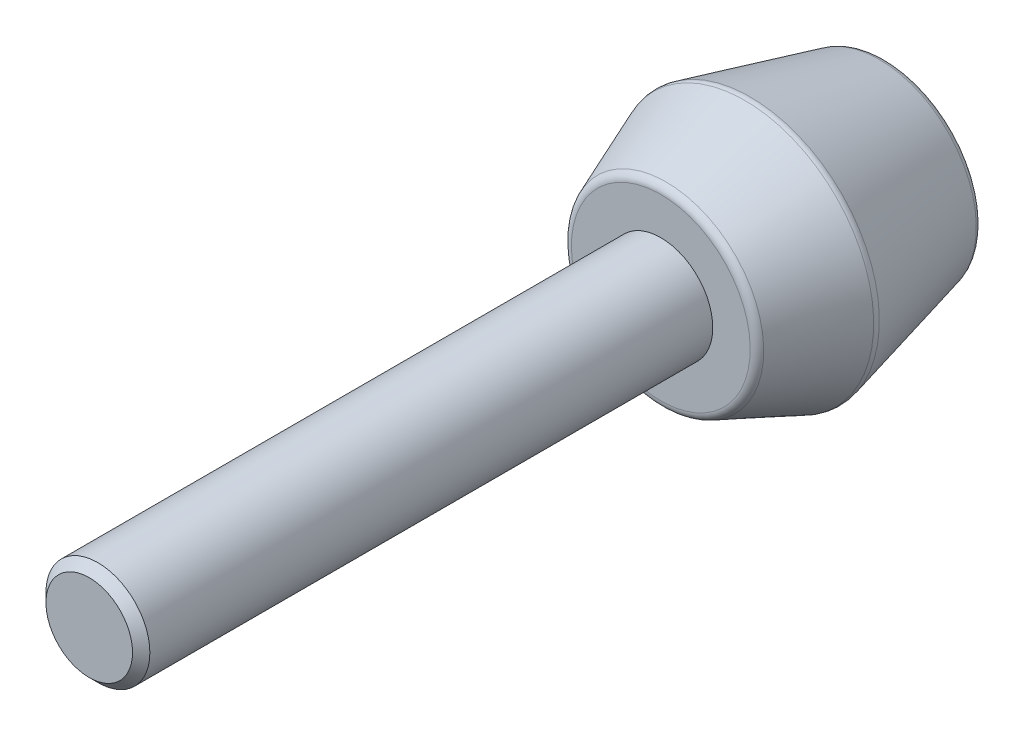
ISO-10303-21;
HEADER;
FILE_DESCRIPTION(('STEP AP214'),'2;1');
FILE_NAME('part.step','',(''),(''),'','','');
FILE_SCHEMA(('AUTOMOTIVE_DESIGN { 1 0 10303 214 1 1 1 1 }'));
ENDSEC;
DATA;
#1=APPLICATION_CONTEXT('core data for automotive mechanical design processes');
#2=APPLICATION_PROTOCOL_DEFINITION('international standard','automotive_design',2000,#1);
#3=PRODUCT_CONTEXT('',#1,'mechanical');
#4=PRODUCT('Part','Part','',(#3));
#5=PRODUCT_RELATED_PRODUCT_CATEGORY('part','',(#4));
#6=PRODUCT_DEFINITION_FORMATION('','',#4);
#7=PRODUCT_DEFINITION_CONTEXT('part definition',#1,'design');
#8=PRODUCT_DEFINITION('design','',#6,#7);
#9=PRODUCT_DEFINITION_SHAPE('','',#8);
#10=(LENGTH_UNIT() NAMED_UNIT(*) SI_UNIT(.MILLI.,.METRE.));
#11=(NAMED_UNIT(*) PLANE_ANGLE_UNIT() SI_UNIT($,.RADIAN.));
#12=(NAMED_UNIT(*) SI_UNIT($,.STERADIAN.) SOLID_ANGLE_UNIT());
#13=UNCERTAINTY_MEASURE_WITH_UNIT(LENGTH_MEASURE(1.E-05),#10,'distance_accuracy_value','');
#14=(GEOMETRIC_REPRESENTATION_CONTEXT(3) GLOBAL_UNCERTAINTY_ASSIGNED_CONTEXT((#13)) GLOBAL_UNIT_ASSIGNED_CONTEXT((#10,
#11,#12)) REPRESENTATION_CONTEXT('',''));
#15=CARTESIAN_POINT('',(0.,0.,0.));
#16=DIRECTION('',(0.,0.,1.));
#17=DIRECTION('',(1.,0.,0.));
#18=AXIS2_PLACEMENT_3D('',#15,#16,#17);
#19=CARTESIAN_POINT('',(0.,0.,13.));
#20=DIRECTION('',(0.,0.,-1.));
#21=DIRECTION('',(0.769087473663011,-0.639143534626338,0.));
#22=AXIS2_PLACEMENT_3D('',#19,#20,#21);
#23=PLANE('',#22);
#24=CARTESIAN_POINT('',(0.,0.,13.));
#25=DIRECTION('',(0.,0.,1.));
#26=DIRECTION('',(-0.769087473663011,0.639143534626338,0.));
#27=AXIS2_PLACEMENT_3D('',#24,#25,#26);
#28=CIRCLE('',#27,3.);
#29=CARTESIAN_POINT('',(-2.30726242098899,1.91743060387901,13.));
#30=VERTEX_POINT('',#29);
#31=EDGE_CURVE('E46',#30,#30,#28,.T.);
#32=ORIENTED_EDGE('',*,*,#31,.F.);
#33=EDGE_LOOP('',(#32));
#34=FACE_BOUND('',#33,.T.);
#35=CARTESIAN_POINT('',(0.,0.,13.));
#36=DIRECTION('',(0.,0.,-1.));
#37=DIRECTION('',(0.769087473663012,-0.639143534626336,0.));
#38=AXIS2_PLACEMENT_3D('',#35,#36,#37);
#39=CIRCLE('',#38,5.16148351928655);
#40=CARTESIAN_POINT('',(3.9696323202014,-3.29892882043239,13.));
#41=VERTEX_POINT('',#40);
#42=CARTESIAN_POINT('',(-3.96963232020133,3.29892882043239,13.));
#43=VERTEX_POINT('',#42);
#44=EDGE_CURVE('E39',#41,#43,#39,.T.);
#45=ORIENTED_EDGE('',*,*,#44,.F.);
#46=CARTESIAN_POINT('',(0.,0.,13.));
#47=DIRECTION('',(0.,0.,-1.));
#48=DIRECTION('',(-0.76908747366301,0.639143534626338,0.));
#49=AXIS2_PLACEMENT_3D('',#46,#47,#48);
#50=CIRCLE('',#49,5.16148351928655);
#51=EDGE_CURVE('E42',#43,#41,#50,.T.);
#52=ORIENTED_EDGE('',*,*,#51,.F.);
#53=EDGE_LOOP('',(#45,#52));
#54=FACE_BOUND('',#53,.T.);
#55=ADVANCED_FACE('F14',(#34,#54),#23,.F.);
#56=CARTESIAN_POINT('',(0.,0.,12.5));
#57=DIRECTION('',(0.,0.,-1.));
#58=DIRECTION('',(0.769087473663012,-0.639143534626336,0.));
#59=AXIS2_PLACEMENT_3D('',#56,#57,#58);
#60=TOROIDAL_SURFACE('',#59,5.16148351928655,0.5);
#61=CARTESIAN_POINT('',(0.,0.,12.6856953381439));
#62=DIRECTION('',(0.,0.,-1.));
#63=DIRECTION('',(0.769087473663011,-0.639143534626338,0.));
#64=AXIS2_PLACEMENT_3D('',#61,#62,#63);
#65=CIRCLE('',#64,5.62572186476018);
#66=CARTESIAN_POINT('',(4.3266722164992,-3.5956437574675,12.6856953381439));
#67=VERTEX_POINT('',#66);
#68=EDGE_CURVE('E51',#67,#67,#65,.T.);
#69=ORIENTED_EDGE('',*,*,#68,.F.);
#70=EDGE_LOOP('',(#69));
#71=FACE_BOUND('',#70,.T.);
#72=ORIENTED_EDGE('',*,*,#44,.T.);
#73=ORIENTED_EDGE('',*,*,#51,.T.);
#74=EDGE_LOOP('',(#72,#73));
#75=FACE_BOUND('',#74,.T.);
#76=ADVANCED_FACE('F50',(#71,#75),#60,.T.);
#77=CARTESIAN_POINT('',(0.,0.,0.));
#78=DIRECTION('',(0.,0.,-1.));
#79=DIRECTION('',(0.769087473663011,-0.639143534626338,0.));
#80=AXIS2_PLACEMENT_3D('',#77,#78,#79);
#81=PLANE('',#80);
#82=CARTESIAN_POINT('',(0.,0.,0.));
#83=DIRECTION('',(0.,0.,1.));
#84=DIRECTION('',(-0.769087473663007,0.639143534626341,0.));
#85=AXIS2_PLACEMENT_3D('',#82,#83,#84);
#86=CIRCLE('',#85,5.10961179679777);
#87=CARTESIAN_POINT('',(-3.92973842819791,3.26577534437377,0.));
#88=VERTEX_POINT('',#87);
#89=CARTESIAN_POINT('',(3.92973842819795,-3.26577534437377,0.));
#90=VERTEX_POINT('',#89);
#91=EDGE_CURVE('E117',#88,#90,#86,.T.);
#92=ORIENTED_EDGE('',*,*,#91,.F.);
#93=CARTESIAN_POINT('',(0.,0.,0.));
#94=DIRECTION('',(0.,0.,1.));
#95=DIRECTION('',(0.769087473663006,-0.639143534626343,0.));
#96=AXIS2_PLACEMENT_3D('',#93,#94,#95);
#97=CIRCLE('',#96,5.10961179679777);
#98=EDGE_CURVE('E30',#90,#88,#97,.T.);
#99=ORIENTED_EDGE('',*,*,#98,.F.);
#100=EDGE_LOOP('',(#92,#99));
#101=FACE_BOUND('',#100,.T.);
#102=ADVANCED_FACE('F70',(#101),#81,.T.);
#103=CARTESIAN_POINT('',(0.,0.,8.15011337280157));
#104=DIRECTION('',(0.,0.,-1.));
#105=DIRECTION('',(0.769087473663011,-0.639143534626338,0.));
#106=AXIS2_PLACEMENT_3D('',#103,#104,#105);
#107=CONICAL_SURFACE('',#106,7.43995465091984,0.380506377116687);
#108=CARTESIAN_POINT('',(0.,0.,8.15011337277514));
#109=DIRECTION('',(0.,0.,-1.));
#110=DIRECTION('',(0.769087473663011,-0.639143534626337,0.));
#111=AXIS2_PLACEMENT_3D('',#108,#109,#110);
#112=CIRCLE('',#111,7.43995465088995);
#113=CARTESIAN_POINT('',(5.72197592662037,-4.75519891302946,8.15011337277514));
#114=VERTEX_POINT('',#113);
#115=EDGE_CURVE('E89',#114,#114,#112,.T.);
#116=ORIENTED_EDGE('',*,*,#115,.F.);
#117=EDGE_LOOP('',(#116));
#118=FACE_BOUND('',#117,.T.);
#119=ORIENTED_EDGE('',*,*,#68,.T.);
#120=EDGE_LOOP('',(#119));
#121=FACE_BOUND('',#120,.T.);
#122=ADVANCED_FACE('F106',(#118,#121),#107,.T.);
#123=CARTESIAN_POINT('',(0.,0.,0.499999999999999));
#124=DIRECTION('',(0.,0.,-1.));
#125=DIRECTION('',(0.769087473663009,-0.63914353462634,0.));
#126=AXIS2_PLACEMENT_3D('',#123,#124,#125);
#127=TOROIDAL_SURFACE('',#126,5.10961179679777,0.5);
#128=ORIENTED_EDGE('',*,*,#98,.T.);
#129=ORIENTED_EDGE('',*,*,#91,.T.);
#130=EDGE_LOOP('',(#128,#129));
#131=FACE_BOUND('',#130,.T.);
#132=CARTESIAN_POINT('',(0.,0.,0.378732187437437));
#133=DIRECTION('',(0.,0.,1.));
#134=DIRECTION('',(-0.769087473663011,0.639143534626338,0.));
#135=AXIS2_PLACEMENT_3D('',#132,#133,#134);
#136=CIRCLE('',#135,5.5946830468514);
#137=CARTESIAN_POINT('',(-4.30280065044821,3.57580549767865,0.378732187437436));
#138=VERTEX_POINT('',#137);
#139=EDGE_CURVE('E78',#138,#138,#136,.T.);
#140=ORIENTED_EDGE('',*,*,#139,.F.);
#141=EDGE_LOOP('',(#140));
#142=FACE_BOUND('',#141,.T.);
#143=ADVANCED_FACE('F95',(#131,#142),#127,.T.);
#144=CARTESIAN_POINT('',(0.,0.,7.96441803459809));
#145=DIRECTION('',(0.,0.,-1.));
#146=DIRECTION('',(0.769087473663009,-0.639143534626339,0.));
#147=AXIS2_PLACEMENT_3D('',#144,#145,#146);
#148=TOROIDAL_SURFACE('',#147,6.97571630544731,0.5);
#149=CARTESIAN_POINT('',(0.,0.,7.84315022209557));
#150=DIRECTION('',(0.,0.,1.));
#151=DIRECTION('',(-0.769087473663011,0.639143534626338,0.));
#152=AXIS2_PLACEMENT_3D('',#149,#150,#151);
#153=CIRCLE('',#152,7.46078755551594);
#154=CARTESIAN_POINT('',(-5.73799825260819,4.76851412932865,7.84315022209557));
#155=VERTEX_POINT('',#154);
#156=EDGE_CURVE('E88',#155,#155,#153,.F.);
#157=ORIENTED_EDGE('',*,*,#156,.F.);
#158=EDGE_LOOP('',(#157));
#159=FACE_BOUND('',#158,.T.);
#160=ORIENTED_EDGE('',*,*,#115,.T.);
#161=EDGE_LOOP('',(#160));
#162=FACE_BOUND('',#161,.T.);
#163=ADVANCED_FACE('F105',(#159,#162),#148,.T.);
#164=CARTESIAN_POINT('',(0.,0.,7.84315022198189));
#165=DIRECTION('',(0.,0.,1.));
#166=DIRECTION('',(-0.769087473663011,0.639143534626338,0.));
#167=AXIS2_PLACEMENT_3D('',#164,#165,#166);
#168=CONICAL_SURFACE('',#167,7.46078755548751,0.244978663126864);
#169=ORIENTED_EDGE('',*,*,#156,.T.);
#170=EDGE_LOOP('',(#169));
#171=FACE_BOUND('',#170,.T.);
#172=ORIENTED_EDGE('',*,*,#139,.T.);
#173=EDGE_LOOP('',(#172));
#174=FACE_BOUND('',#173,.T.);
#175=ADVANCED_FACE('F158',(#171,#174),#168,.T.);
#176=CARTESIAN_POINT('',(0.,0.,2.5));
#177=DIRECTION('',(0.,0.,1.));
#178=DIRECTION('',(-0.692341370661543,0.721570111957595,0.));
#179=AXIS2_PLACEMENT_3D('',#176,#177,#178);
#180=CYLINDRICAL_SURFACE('',#179,3.);
#181=CARTESIAN_POINT('',(0.,0.,45.5));
#182=DIRECTION('',(0.,0.,1.));
#183=DIRECTION('',(1.,0.,0.));
#184=AXIS2_PLACEMENT_3D('',#181,#182,#183);
#185=CIRCLE('',#184,3.);
#186=CARTESIAN_POINT('',(3.,0.,45.5));
#187=VERTEX_POINT('',#186);
#188=EDGE_CURVE('E9',#187,#187,#185,.F.);
#189=ORIENTED_EDGE('',*,*,#188,.T.);
#190=EDGE_LOOP('',(#189));
#191=FACE_BOUND('',#190,.T.);
#192=ORIENTED_EDGE('',*,*,#31,.T.);
#193=EDGE_LOOP('',(#192));
#194=FACE_BOUND('',#193,.T.);
#195=ADVANCED_FACE('F173',(#191,#194),#180,.T.);
#196=CARTESIAN_POINT('',(0.,0.,46.));
#197=DIRECTION('',(0.,0.,1.));
#198=DIRECTION('',(1.,0.,0.));
#199=AXIS2_PLACEMENT_3D('',#196,#197,#198);
#200=PLANE('',#199);
#201=CARTESIAN_POINT('',(0.,0.,46.));
#202=DIRECTION('',(0.,0.,1.));
#203=DIRECTION('',(1.,0.,0.));
#204=AXIS2_PLACEMENT_3D('',#201,#202,#203);
#205=CIRCLE('',#204,2.49999999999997);
#206=CARTESIAN_POINT('',(2.49999999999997,0.,46.));
#207=VERTEX_POINT('',#206);
#208=EDGE_CURVE('E23',#207,#207,#205,.T.);
#209=ORIENTED_EDGE('',*,*,#208,.T.);
#210=EDGE_LOOP('',(#209));
#211=FACE_BOUND('',#210,.T.);
#212=ADVANCED_FACE('F175',(#211),#200,.T.);
#213=CARTESIAN_POINT('',(0.,0.,46.));
#214=DIRECTION('',(0.,0.,-1.));
#215=DIRECTION('',(-1.,0.,0.));
#216=AXIS2_PLACEMENT_3D('',#213,#214,#215);
#217=CONICAL_SURFACE('',#216,2.49999999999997,0.785398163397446);
#218=ORIENTED_EDGE('',*,*,#188,.F.);
#219=EDGE_LOOP('',(#218));
#220=FACE_BOUND('',#219,.T.);
#221=ORIENTED_EDGE('',*,*,#208,.F.);
#222=EDGE_LOOP('',(#221));
#223=FACE_BOUND('',#222,.T.);
#224=ADVANCED_FACE('F16',(#220,#223),#217,.T.);
#225=CLOSED_SHELL('',(#55,#76,#102,#122,#143,#163,#175,#195,#212,#224));
#226=MANIFOLD_SOLID_BREP('B1',#225);
#227=ADVANCED_BREP_SHAPE_REPRESENTATION('',(#18,#226),#14);
#228=SHAPE_DEFINITION_REPRESENTATION(#9,#227);
ENDSEC;
END-ISO-10303-21;
